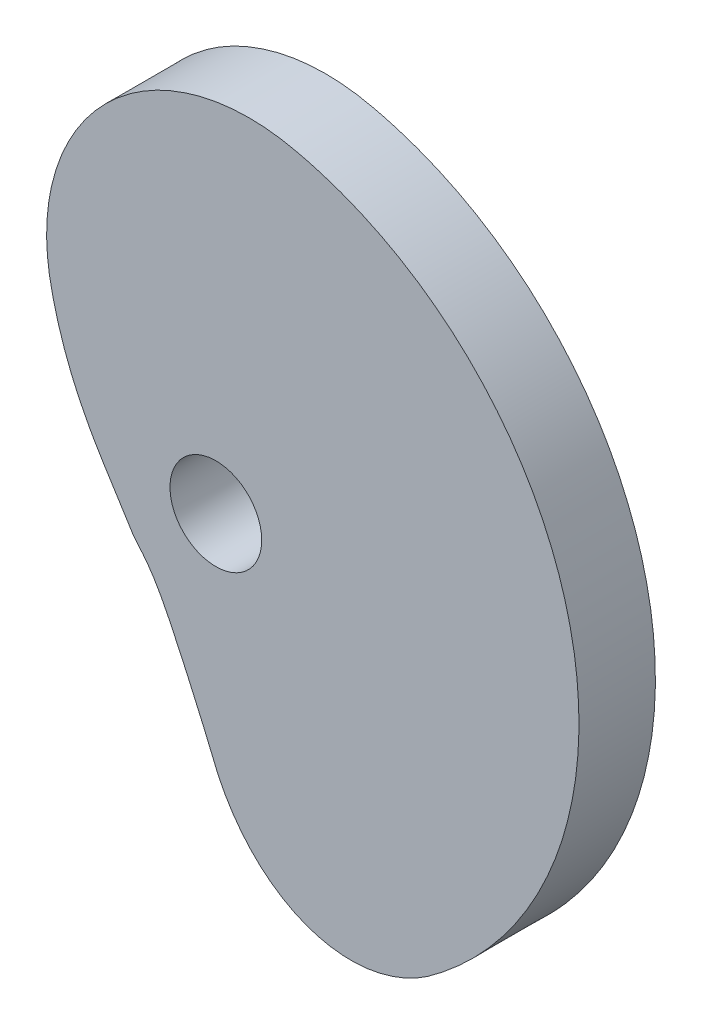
ISO-10303-21;
HEADER;
FILE_DESCRIPTION(('STEP AP214'),'2;1');
FILE_NAME('part.step','',(''),(''),'','','');
FILE_SCHEMA(('AUTOMOTIVE_DESIGN { 1 0 10303 214 1 1 1 1 }'));
ENDSEC;
DATA;
#1=APPLICATION_CONTEXT('core data for automotive mechanical design processes');
#2=APPLICATION_PROTOCOL_DEFINITION('international standard','automotive_design',2000,#1);
#3=PRODUCT_CONTEXT('',#1,'mechanical');
#4=PRODUCT('Part','Part','',(#3));
#5=PRODUCT_RELATED_PRODUCT_CATEGORY('part','',(#4));
#6=PRODUCT_DEFINITION_FORMATION('','',#4);
#7=PRODUCT_DEFINITION_CONTEXT('part definition',#1,'design');
#8=PRODUCT_DEFINITION('design','',#6,#7);
#9=PRODUCT_DEFINITION_SHAPE('','',#8);
#10=(LENGTH_UNIT() NAMED_UNIT(*) SI_UNIT(.MILLI.,.METRE.));
#11=(NAMED_UNIT(*) PLANE_ANGLE_UNIT() SI_UNIT($,.RADIAN.));
#12=(NAMED_UNIT(*) SI_UNIT($,.STERADIAN.) SOLID_ANGLE_UNIT());
#13=UNCERTAINTY_MEASURE_WITH_UNIT(LENGTH_MEASURE(1.E-05),#10,'distance_accuracy_value','');
#14=(GEOMETRIC_REPRESENTATION_CONTEXT(3) GLOBAL_UNCERTAINTY_ASSIGNED_CONTEXT((#13)) GLOBAL_UNIT_ASSIGNED_CONTEXT((#10,
#11,#12)) REPRESENTATION_CONTEXT('',''));
#15=CARTESIAN_POINT('',(0.,0.,0.));
#16=DIRECTION('',(0.,0.,1.));
#17=DIRECTION('',(1.,0.,0.));
#18=AXIS2_PLACEMENT_3D('',#15,#16,#17);
#19=CARTESIAN_POINT('',(-243.24,399.51,20.));
#20=CARTESIAN_POINT('',(-244.338434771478,399.760268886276,20.));
#21=CARTESIAN_POINT('',(-246.531233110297,400.226111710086,20.));
#22=CARTESIAN_POINT('',(-249.865205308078,400.696137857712,20.));
#23=CARTESIAN_POINT('',(-253.225113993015,400.954969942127,20.));
#24=CARTESIAN_POINT('',(-256.621936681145,401.0070308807,20.));
#25=CARTESIAN_POINT('',(-260.038887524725,400.835337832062,20.));
#26=CARTESIAN_POINT('',(-263.4666556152,400.446376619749,20.));
#27=CARTESIAN_POINT('',(-266.884264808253,399.825919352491,20.));
#28=CARTESIAN_POINT('',(-270.276058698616,398.977262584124,20.));
#29=CARTESIAN_POINT('',(-273.620748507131,397.890793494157,20.));
#30=CARTESIAN_POINT('',(-276.91421130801,396.59313017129,20.));
#31=CARTESIAN_POINT('',(-280.134886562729,395.065386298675,20.));
#32=CARTESIAN_POINT('',(-283.25851252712,393.298166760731,20.));
#33=CARTESIAN_POINT('',(-286.274131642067,391.323726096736,20.));
#34=CARTESIAN_POINT('',(-289.16299282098,389.134181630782,20.));
#35=CARTESIAN_POINT('',(-291.914147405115,386.75054482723,20.));
#36=CARTESIAN_POINT('',(-294.48975810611,384.156734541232,20.));
#37=CARTESIAN_POINT('',(-296.89836174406,381.389877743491,20.));
#38=CARTESIAN_POINT('',(-299.11378921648,378.458418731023,20.));
#39=CARTESIAN_POINT('',(-301.118346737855,375.368362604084,20.));
#40=CARTESIAN_POINT('',(-302.904366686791,372.148714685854,20.));
#41=CARTESIAN_POINT('',(-304.482469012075,368.820540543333,20.));
#42=CARTESIAN_POINT('',(-305.799253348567,365.384331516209,20.));
#43=CARTESIAN_POINT('',(-306.875225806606,361.878119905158,20.));
#44=CARTESIAN_POINT('',(-307.722963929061,358.325895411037,20.));
#45=CARTESIAN_POINT('',(-308.300140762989,354.742159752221,20.));
#46=CARTESIAN_POINT('',(-308.627718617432,351.156996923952,20.));
#47=CARTESIAN_POINT('',(-308.72197339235,347.592170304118,20.));
#48=CARTESIAN_POINT('',(-308.565447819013,344.072017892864,20.));
#49=CARTESIAN_POINT('',(-308.206654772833,340.616249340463,20.));
#50=CARTESIAN_POINT('',(-307.601808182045,337.289385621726,20.));
#51=CARTESIAN_POINT('',(-306.901779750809,334.135229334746,20.));
#52=CARTESIAN_POINT('',(-306.153436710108,331.187218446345,20.));
#53=CARTESIAN_POINT('',(-305.355444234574,328.450284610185,20.));
#54=CARTESIAN_POINT('',(-304.552837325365,325.90012362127,20.));
#55=CARTESIAN_POINT('',(-303.713850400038,323.530052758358,20.));
#56=CARTESIAN_POINT('',(-302.878924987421,321.321887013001,20.));
#57=CARTESIAN_POINT('',(-302.030151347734,319.266283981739,20.));
#58=CARTESIAN_POINT('',(-301.20682356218,317.341305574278,20.));
#59=CARTESIAN_POINT('',(-300.36734876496,315.551608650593,20.));
#60=CARTESIAN_POINT('',(-299.563166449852,313.86684402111,20.));
#61=CARTESIAN_POINT('',(-298.755790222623,312.295258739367,20.));
#62=CARTESIAN_POINT('',(-297.978895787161,310.813423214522,20.));
#63=CARTESIAN_POINT('',(-297.211878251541,309.420479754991,20.));
#64=CARTESIAN_POINT('',(-296.479837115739,308.097167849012,20.));
#65=CARTESIAN_POINT('',(-295.736862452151,306.858498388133,20.));
#66=CARTESIAN_POINT('',(-295.046334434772,305.667576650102,20.));
#67=CARTESIAN_POINT('',(-294.360714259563,304.544168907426,20.));
#68=CARTESIAN_POINT('',(-293.696735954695,303.475340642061,20.));
#69=CARTESIAN_POINT('',(-293.069209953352,302.439713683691,20.));
#70=CARTESIAN_POINT('',(-292.449979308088,301.449104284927,20.));
#71=CARTESIAN_POINT('',(-291.834462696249,300.503524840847,20.));
#72=CARTESIAN_POINT('',(-291.25515606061,299.575510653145,20.));
#73=CARTESIAN_POINT('',(-290.686333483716,298.680213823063,20.));
#74=CARTESIAN_POINT('',(-290.13348723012,297.808661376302,20.));
#75=CARTESIAN_POINT('',(-289.604261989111,296.956087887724,20.));
#76=CARTESIAN_POINT('',(-289.083251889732,296.121284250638,20.));
#77=CARTESIAN_POINT('',(-288.560653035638,295.30710294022,20.));
#78=CARTESIAN_POINT('',(-288.0602445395,294.491877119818,20.));
#79=CARTESIAN_POINT('',(-287.570411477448,293.685106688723,20.));
#80=CARTESIAN_POINT('',(-287.09652465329,292.878533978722,20.));
#81=CARTESIAN_POINT('',(-286.592206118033,292.095207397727,20.));
#82=CARTESIAN_POINT('',(-286.06489875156,291.32602608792,20.));
#83=CARTESIAN_POINT('',(-285.507253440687,290.579139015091,20.));
#84=CARTESIAN_POINT('',(-284.919837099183,289.855189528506,20.));
#85=CARTESIAN_POINT('',(-284.319062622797,289.142821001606,20.));
#86=CARTESIAN_POINT('',(-283.667868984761,288.477375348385,20.));
#87=CARTESIAN_POINT('',(-283.112596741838,287.734380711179,20.));
#88=CARTESIAN_POINT('',(-282.532890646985,287.013878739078,20.));
#89=CARTESIAN_POINT('',(-281.986673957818,286.25805123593,20.));
#90=CARTESIAN_POINT('',(-281.441817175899,285.48786481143,20.));
#91=CARTESIAN_POINT('',(-280.914280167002,284.683708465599,20.));
#92=CARTESIAN_POINT('',(-280.381928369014,283.857095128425,20.));
#93=CARTESIAN_POINT('',(-279.860334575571,282.987074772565,20.));
#94=CARTESIAN_POINT('',(-279.33246823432,282.086187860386,20.));
#95=CARTESIAN_POINT('',(-278.809457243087,281.137212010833,20.));
#96=CARTESIAN_POINT('',(-278.285352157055,280.14562516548,20.));
#97=CARTESIAN_POINT('',(-277.722205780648,279.115864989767,20.));
#98=CARTESIAN_POINT('',(-277.18415993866,278.012881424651,20.));
#99=CARTESIAN_POINT('',(-276.605812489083,276.860364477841,20.));
#100=CARTESIAN_POINT('',(-276.019996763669,275.636660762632,20.));
#101=CARTESIAN_POINT('',(-275.396410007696,274.349961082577,20.));
#102=CARTESIAN_POINT('',(-274.757483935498,272.979616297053,20.));
#103=CARTESIAN_POINT('',(-274.071066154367,271.530807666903,20.));
#104=CARTESIAN_POINT('',(-273.367530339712,269.974736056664,20.));
#105=CARTESIAN_POINT('',(-272.598147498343,268.323889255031,20.));
#106=CARTESIAN_POINT('',(-271.802729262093,266.545428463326,20.));
#107=CARTESIAN_POINT('',(-270.934470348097,264.64398025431,20.));
#108=CARTESIAN_POINT('',(-270.026113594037,262.588371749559,20.));
#109=CARTESIAN_POINT('',(-269.050639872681,260.364514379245,20.));
#110=CARTESIAN_POINT('',(-267.997598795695,257.953924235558,20.));
#111=CARTESIAN_POINT('',(-266.869329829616,255.315883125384,20.));
#112=CARTESIAN_POINT('',(-265.6664889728,252.427622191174,20.));
#113=CARTESIAN_POINT('',(-264.441191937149,249.338374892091,20.));
#114=CARTESIAN_POINT('',(-262.978970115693,246.255685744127,20.));
#115=CARTESIAN_POINT('',(-261.33026954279,243.289519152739,20.));
#116=CARTESIAN_POINT('',(-259.496696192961,240.480353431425,20.));
#117=CARTESIAN_POINT('',(-257.509921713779,237.824749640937,20.));
#118=CARTESIAN_POINT('',(-255.35707216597,235.351664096,20.));
#119=CARTESIAN_POINT('',(-253.057169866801,233.069066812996,20.));
#120=CARTESIAN_POINT('',(-250.617301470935,230.988567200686,20.));
#121=CARTESIAN_POINT('',(-248.02814847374,229.154823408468,20.));
#122=CARTESIAN_POINT('',(-245.34241726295,227.519719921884,20.));
#123=CARTESIAN_POINT('',(-242.534325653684,226.165569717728,20.));
#124=CARTESIAN_POINT('',(-239.646979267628,225.0472381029,20.));
#125=CARTESIAN_POINT('',(-236.683176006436,224.194352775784,20.));
#126=CARTESIAN_POINT('',(-233.657017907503,223.619431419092,20.));
#127=CARTESIAN_POINT('',(-230.589657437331,223.348274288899,20.));
#128=CARTESIAN_POINT('',(-227.503123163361,223.32665187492,20.));
#129=CARTESIAN_POINT('',(-224.414130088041,223.627462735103,20.));
#130=CARTESIAN_POINT('',(-221.341112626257,224.194800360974,20.));
#131=CARTESIAN_POINT('',(-218.307526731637,225.050509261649,20.));
#132=CARTESIAN_POINT('',(-215.326192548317,226.170586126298,20.));
#133=CARTESIAN_POINT('',(-212.429925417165,227.577866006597,20.));
#134=CARTESIAN_POINT('',(-209.612541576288,229.232475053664,20.));
#135=CARTESIAN_POINT('',(-206.960990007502,231.190015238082,20.));
#136=CARTESIAN_POINT('',(-204.344722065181,233.221403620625,20.));
#137=CARTESIAN_POINT('',(-201.816072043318,235.367702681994,20.));
#138=CARTESIAN_POINT('',(-199.361707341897,237.595848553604,20.));
#139=CARTESIAN_POINT('',(-196.97002412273,239.896873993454,20.));
#140=CARTESIAN_POINT('',(-194.679257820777,242.295671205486,20.));
#141=CARTESIAN_POINT('',(-192.46645092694,244.765680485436,20.));
#142=CARTESIAN_POINT('',(-190.343525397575,247.31187005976,20.));
#143=CARTESIAN_POINT('',(-188.30383664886,249.926208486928,20.));
#144=CARTESIAN_POINT('',(-186.365717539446,252.616963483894,20.));
#145=CARTESIAN_POINT('',(-184.522561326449,255.372729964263,20.));
#146=CARTESIAN_POINT('',(-182.772683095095,258.189810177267,20.));
#147=CARTESIAN_POINT('',(-181.125309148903,261.070200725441,20.));
#148=CARTESIAN_POINT('',(-179.571825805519,263.998900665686,20.));
#149=CARTESIAN_POINT('',(-178.132902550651,266.983409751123,20.));
#150=CARTESIAN_POINT('',(-176.793004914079,270.015326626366,20.));
#151=CARTESIAN_POINT('',(-175.548771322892,273.090068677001,20.));
#152=CARTESIAN_POINT('',(-174.434786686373,276.216802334,20.));
#153=CARTESIAN_POINT('',(-173.409077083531,279.371532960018,20.));
#154=CARTESIAN_POINT('',(-172.512306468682,282.565723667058,20.));
#155=CARTESIAN_POINT('',(-171.722055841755,285.784232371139,20.));
#156=CARTESIAN_POINT('',(-171.041336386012,289.029344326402,20.));
#157=CARTESIAN_POINT('',(-170.469584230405,292.293948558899,20.));
#158=CARTESIAN_POINT('',(-170.022599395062,295.58016467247,20.));
#159=CARTESIAN_POINT('',(-169.678532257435,298.878127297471,20.));
#160=CARTESIAN_POINT('',(-169.463189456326,302.187355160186,20.));
#161=CARTESIAN_POINT('',(-169.349254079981,305.502362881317,20.));
#162=CARTESIAN_POINT('',(-169.359550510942,308.817983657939,20.));
#163=CARTESIAN_POINT('',(-169.492258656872,312.133066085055,20.));
#164=CARTESIAN_POINT('',(-169.732115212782,315.441504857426,20.));
#165=CARTESIAN_POINT('',(-170.079216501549,318.74087524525,20.));
#166=CARTESIAN_POINT('',(-170.549546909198,322.023162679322,20.));
#167=CARTESIAN_POINT('',(-171.142262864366,325.28415949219,20.));
#168=CARTESIAN_POINT('',(-171.842577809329,328.525942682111,20.));
#169=CARTESIAN_POINT('',(-172.64969802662,331.74208821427,20.));
#170=CARTESIAN_POINT('',(-173.573390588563,334.926373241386,20.));
#171=CARTESIAN_POINT('',(-174.598541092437,338.078064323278,20.));
#172=CARTESIAN_POINT('',(-175.753998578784,341.185929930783,20.));
#173=CARTESIAN_POINT('',(-177.005044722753,344.257127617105,20.));
#174=CARTESIAN_POINT('',(-178.348658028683,347.292146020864,20.));
#175=CARTESIAN_POINT('',(-179.82449031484,350.263420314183,20.));
#176=CARTESIAN_POINT('',(-181.382703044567,353.193362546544,20.));
#177=CARTESIAN_POINT('',(-183.051813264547,356.055915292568,20.));
#178=CARTESIAN_POINT('',(-184.817882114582,358.862874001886,20.));
#179=CARTESIAN_POINT('',(-186.669080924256,361.611616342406,20.));
#180=CARTESIAN_POINT('',(-188.639022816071,364.281135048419,20.));
#181=CARTESIAN_POINT('',(-190.681620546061,366.892763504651,20.));
#182=CARTESIAN_POINT('',(-192.82826486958,369.420239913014,20.));
#183=CARTESIAN_POINT('',(-195.044783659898,371.885604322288,20.));
#184=CARTESIAN_POINT('',(-197.357567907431,374.262650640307,20.));
#185=CARTESIAN_POINT('',(-199.745443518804,376.564332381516,20.));
#186=CARTESIAN_POINT('',(-202.216753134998,378.776379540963,20.));
#187=CARTESIAN_POINT('',(-204.771201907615,380.893241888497,20.));
#188=CARTESIAN_POINT('',(-207.385829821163,382.93663644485,20.));
#189=CARTESIAN_POINT('',(-210.077127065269,384.874046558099,20.));
#190=CARTESIAN_POINT('',(-212.83245336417,386.717910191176,20.));
#191=CARTESIAN_POINT('',(-215.648298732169,388.464137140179,20.));
#192=CARTESIAN_POINT('',(-218.521659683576,390.117993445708,20.));
#193=CARTESIAN_POINT('',(-221.453728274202,391.668558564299,20.));
#194=CARTESIAN_POINT('',(-224.438994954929,393.11575216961,20.));
#195=CARTESIAN_POINT('',(-227.472749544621,394.460327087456,20.));
#196=CARTESIAN_POINT('',(-230.554929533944,395.684924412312,20.));
#197=CARTESIAN_POINT('',(-233.669294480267,396.820716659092,20.));
#198=CARTESIAN_POINT('',(-236.828517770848,397.825543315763,20.));
#199=CARTESIAN_POINT('',(-240.013541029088,398.742189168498,20.));
#200=CARTESIAN_POINT('',(-242.162250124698,399.264443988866,20.));
#201=CARTESIAN_POINT('',(-243.24,399.51,20.));
#202=B_SPLINE_CURVE_WITH_KNOTS('',3,(#19,#20,#21,#22,#23,#24,#25,#26,#27,#28,#29,#30,#31,#32,
#33,#34,#35,#36,#37,#38,#39,#40,#41,#42,#43,#44,#45,#46,#47,#48,#49,#50,#51,#52,#53,#54,#55,#56,
#57,#58,#59,#60,#61,#62,#63,#64,#65,#66,#67,#68,#69,#70,#71,#72,#73,#74,#75,#76,#77,#78,#79,#80,
#81,#82,#83,#84,#85,#86,#87,#88,#89,#90,#91,#92,#93,#94,#95,#96,#97,#98,#99,#100,#101,#102,#103,
#104,#105,#106,#107,#108,#109,#110,#111,#112,#113,#114,#115,#116,#117,#118,#119,#120,#121,#122,
#123,#124,#125,#126,#127,#128,#129,#130,#131,#132,#133,#134,#135,#136,#137,#138,#139,#140,#141,
#142,#143,#144,#145,#146,#147,#148,#149,#150,#151,#152,#153,#154,#155,#156,#157,#158,#159,#160,
#161,#162,#163,#164,#165,#166,#167,#168,#169,#170,#171,#172,#173,#174,#175,#176,#177,#178,#179,
#180,#181,#182,#183,#184,#185,#186,#187,#188,#189,#190,#191,#192,#193,#194,#195,#196,#197,#198,
#199,#200,#201),.UNSPECIFIED.,.T.,.F.,(4,1,1,1,1,1,1,1,1,1,1,1,1,1,1,1,1,1,1,1,1,1,1,1,1,1,1,1,
1,1,1,1,1,1,1,1,1,1,1,1,1,1,1,1,1,1,1,1,1,1,1,1,1,1,1,1,1,1,1,1,1,1,1,1,1,1,1,1,1,1,1,1,1,1,1,1,
1,1,1,1,1,1,1,1,1,1,1,1,1,1,1,1,1,1,1,1,1,1,1,1,1,1,1,1,1,1,1,1,1,1,1,1,1,1,1,1,1,1,1,1,1,1,1,1,
1,1,1,1,1,1,1,1,1,1,1,1,1,1,1,1,1,1,1,1,1,1,1,1,1,1,1,1,1,1,1,1,1,1,1,1,1,1,1,1,1,1,1,1,1,1,1,1,
1,1,1,1,1,1,1,1,4),(0.,0.00688265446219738,0.0136921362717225,0.0205562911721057,
0.0274618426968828,0.0344363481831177,0.0414473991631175,0.0485268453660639,0.0556453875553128,
0.0627951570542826,0.070000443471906,0.0772617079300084,0.0845579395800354,0.0919132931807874,
0.0992703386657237,0.106691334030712,0.114137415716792,0.121587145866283,0.129090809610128,
0.136570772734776,0.144074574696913,0.151573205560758,0.159058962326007,0.166538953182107,
0.173969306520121,0.181356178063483,0.188699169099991,0.195952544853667,0.203128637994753,
0.210216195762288,0.217164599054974,0.223776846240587,0.22995685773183,0.235745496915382,
0.241195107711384,0.246290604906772,0.251106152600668,0.255618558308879,0.259879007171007,
0.263897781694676,0.267696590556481,0.271285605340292,0.274693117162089,0.277919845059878,
0.281002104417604,0.283932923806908,0.286744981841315,0.289413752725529,0.291974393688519,
0.294433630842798,0.296812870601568,0.299112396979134,0.301327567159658,0.303497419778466,
0.305593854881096,0.30763412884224,0.309629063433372,0.311606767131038,0.313545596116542,
0.315473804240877,0.317374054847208,0.319261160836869,0.321165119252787,0.3230715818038,
0.324954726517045,0.326861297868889,0.32876438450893,0.330634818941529,0.332521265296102,
0.334415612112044,0.336331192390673,0.338285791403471,0.340291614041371,0.34233858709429,
0.344483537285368,0.346671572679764,0.348958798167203,0.351337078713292,0.353842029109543,
0.356456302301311,0.359216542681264,0.36213174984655,0.36519321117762,0.368455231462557,
0.371927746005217,0.375627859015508,0.379584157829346,0.383832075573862,0.388400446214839,
0.393316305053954,0.398670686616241,0.404474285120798,0.410847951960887,0.417788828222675,
0.424776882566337,0.431679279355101,0.438509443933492,0.44525944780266,0.4519293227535,
0.45852570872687,0.465043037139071,0.471497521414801,0.477893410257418,0.48423363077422,
0.49052026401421,0.496792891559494,0.50305267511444,0.509311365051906,0.515584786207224,
0.521885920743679,0.528245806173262,0.534655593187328,0.541120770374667,0.547679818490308,
0.554309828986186,0.561053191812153,0.56780046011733,0.574549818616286,0.581312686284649,
0.588054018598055,0.594824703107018,0.601575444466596,0.608314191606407,0.615077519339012,
0.621832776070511,0.628572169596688,0.635332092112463,0.642092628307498,0.648844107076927,
0.655585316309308,0.66233344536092,0.669096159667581,0.675848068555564,0.682611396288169,
0.68936247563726,0.696115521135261,0.702858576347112,0.709619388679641,0.716362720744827,
0.723119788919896,0.729876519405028,0.73662209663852,0.743384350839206,0.750131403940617,
0.756890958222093,0.763650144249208,0.770399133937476,0.777147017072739,0.783898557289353,
0.790661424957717,0.797404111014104,0.804154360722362,0.810908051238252,0.817659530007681,
0.824415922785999,0.831183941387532,0.837926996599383,0.844690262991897,0.851426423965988,
0.858188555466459,0.864934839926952,0.871694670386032,0.878444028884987,0.885193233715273,
0.891948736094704,0.898704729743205,0.905455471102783,0.912209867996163,0.918973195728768,
0.925728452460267,0.932467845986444,0.939227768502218,0.945970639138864,0.952722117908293,
0.959490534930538,0.96623866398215,0.972993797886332,0.979752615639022,0.986490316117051,
0.993246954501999,1.),.UNSPECIFIED.);
#203=DIRECTION('',(0.,0.,-1.));
#204=VECTOR('',#203,1.);
#205=SURFACE_OF_LINEAR_EXTRUSION('',#202,#204);
#206=CARTESIAN_POINT('',(-243.24,399.51,20.));
#207=VERTEX_POINT('',#206);
#208=EDGE_CURVE('E10',#207,#207,#202,.T.);
#209=ORIENTED_EDGE('',*,*,#208,.F.);
#210=EDGE_LOOP('',(#209));
#211=FACE_BOUND('',#210,.T.);
#212=CARTESIAN_POINT('',(-243.24,399.51,0.));
#213=CARTESIAN_POINT('',(-244.338434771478,399.760268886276,0.));
#214=CARTESIAN_POINT('',(-246.531233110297,400.226111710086,0.));
#215=CARTESIAN_POINT('',(-249.865205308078,400.696137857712,0.));
#216=CARTESIAN_POINT('',(-253.225113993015,400.954969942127,0.));
#217=CARTESIAN_POINT('',(-256.621936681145,401.0070308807,0.));
#218=CARTESIAN_POINT('',(-260.038887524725,400.835337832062,0.));
#219=CARTESIAN_POINT('',(-263.4666556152,400.446376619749,0.));
#220=CARTESIAN_POINT('',(-266.884264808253,399.825919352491,0.));
#221=CARTESIAN_POINT('',(-270.276058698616,398.977262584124,0.));
#222=CARTESIAN_POINT('',(-273.620748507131,397.890793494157,0.));
#223=CARTESIAN_POINT('',(-276.91421130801,396.59313017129,0.));
#224=CARTESIAN_POINT('',(-280.134886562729,395.065386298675,0.));
#225=CARTESIAN_POINT('',(-283.25851252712,393.298166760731,0.));
#226=CARTESIAN_POINT('',(-286.274131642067,391.323726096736,0.));
#227=CARTESIAN_POINT('',(-289.16299282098,389.134181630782,0.));
#228=CARTESIAN_POINT('',(-291.914147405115,386.75054482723,0.));
#229=CARTESIAN_POINT('',(-294.48975810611,384.156734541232,0.));
#230=CARTESIAN_POINT('',(-296.89836174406,381.389877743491,0.));
#231=CARTESIAN_POINT('',(-299.11378921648,378.458418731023,0.));
#232=CARTESIAN_POINT('',(-301.118346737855,375.368362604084,0.));
#233=CARTESIAN_POINT('',(-302.904366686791,372.148714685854,0.));
#234=CARTESIAN_POINT('',(-304.482469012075,368.820540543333,0.));
#235=CARTESIAN_POINT('',(-305.799253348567,365.384331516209,0.));
#236=CARTESIAN_POINT('',(-306.875225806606,361.878119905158,0.));
#237=CARTESIAN_POINT('',(-307.722963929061,358.325895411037,0.));
#238=CARTESIAN_POINT('',(-308.300140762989,354.742159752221,0.));
#239=CARTESIAN_POINT('',(-308.627718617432,351.156996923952,0.));
#240=CARTESIAN_POINT('',(-308.72197339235,347.592170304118,0.));
#241=CARTESIAN_POINT('',(-308.565447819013,344.072017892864,0.));
#242=CARTESIAN_POINT('',(-308.206654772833,340.616249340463,0.));
#243=CARTESIAN_POINT('',(-307.601808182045,337.289385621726,0.));
#244=CARTESIAN_POINT('',(-306.901779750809,334.135229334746,0.));
#245=CARTESIAN_POINT('',(-306.153436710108,331.187218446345,0.));
#246=CARTESIAN_POINT('',(-305.355444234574,328.450284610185,0.));
#247=CARTESIAN_POINT('',(-304.552837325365,325.90012362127,0.));
#248=CARTESIAN_POINT('',(-303.713850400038,323.530052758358,0.));
#249=CARTESIAN_POINT('',(-302.878924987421,321.321887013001,0.));
#250=CARTESIAN_POINT('',(-302.030151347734,319.266283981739,0.));
#251=CARTESIAN_POINT('',(-301.20682356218,317.341305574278,0.));
#252=CARTESIAN_POINT('',(-300.36734876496,315.551608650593,0.));
#253=CARTESIAN_POINT('',(-299.563166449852,313.86684402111,0.));
#254=CARTESIAN_POINT('',(-298.755790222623,312.295258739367,0.));
#255=CARTESIAN_POINT('',(-297.978895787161,310.813423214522,0.));
#256=CARTESIAN_POINT('',(-297.211878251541,309.420479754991,0.));
#257=CARTESIAN_POINT('',(-296.479837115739,308.097167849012,0.));
#258=CARTESIAN_POINT('',(-295.736862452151,306.858498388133,0.));
#259=CARTESIAN_POINT('',(-295.046334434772,305.667576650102,0.));
#260=CARTESIAN_POINT('',(-294.360714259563,304.544168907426,0.));
#261=CARTESIAN_POINT('',(-293.696735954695,303.475340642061,0.));
#262=CARTESIAN_POINT('',(-293.069209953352,302.439713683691,0.));
#263=CARTESIAN_POINT('',(-292.449979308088,301.449104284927,0.));
#264=CARTESIAN_POINT('',(-291.834462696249,300.503524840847,0.));
#265=CARTESIAN_POINT('',(-291.25515606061,299.575510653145,0.));
#266=CARTESIAN_POINT('',(-290.686333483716,298.680213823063,0.));
#267=CARTESIAN_POINT('',(-290.13348723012,297.808661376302,0.));
#268=CARTESIAN_POINT('',(-289.604261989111,296.956087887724,0.));
#269=CARTESIAN_POINT('',(-289.083251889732,296.121284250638,0.));
#270=CARTESIAN_POINT('',(-288.560653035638,295.30710294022,0.));
#271=CARTESIAN_POINT('',(-288.0602445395,294.491877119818,0.));
#272=CARTESIAN_POINT('',(-287.570411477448,293.685106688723,0.));
#273=CARTESIAN_POINT('',(-287.09652465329,292.878533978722,0.));
#274=CARTESIAN_POINT('',(-286.592206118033,292.095207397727,0.));
#275=CARTESIAN_POINT('',(-286.06489875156,291.32602608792,0.));
#276=CARTESIAN_POINT('',(-285.507253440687,290.579139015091,0.));
#277=CARTESIAN_POINT('',(-284.919837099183,289.855189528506,0.));
#278=CARTESIAN_POINT('',(-284.319062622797,289.142821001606,0.));
#279=CARTESIAN_POINT('',(-283.667868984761,288.477375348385,0.));
#280=CARTESIAN_POINT('',(-283.112596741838,287.734380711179,0.));
#281=CARTESIAN_POINT('',(-282.532890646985,287.013878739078,0.));
#282=CARTESIAN_POINT('',(-281.986673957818,286.25805123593,0.));
#283=CARTESIAN_POINT('',(-281.441817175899,285.48786481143,0.));
#284=CARTESIAN_POINT('',(-280.914280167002,284.683708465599,0.));
#285=CARTESIAN_POINT('',(-280.381928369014,283.857095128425,0.));
#286=CARTESIAN_POINT('',(-279.860334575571,282.987074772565,0.));
#287=CARTESIAN_POINT('',(-279.33246823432,282.086187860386,0.));
#288=CARTESIAN_POINT('',(-278.809457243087,281.137212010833,0.));
#289=CARTESIAN_POINT('',(-278.285352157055,280.14562516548,0.));
#290=CARTESIAN_POINT('',(-277.722205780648,279.115864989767,0.));
#291=CARTESIAN_POINT('',(-277.18415993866,278.012881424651,0.));
#292=CARTESIAN_POINT('',(-276.605812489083,276.860364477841,0.));
#293=CARTESIAN_POINT('',(-276.019996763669,275.636660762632,0.));
#294=CARTESIAN_POINT('',(-275.396410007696,274.349961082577,0.));
#295=CARTESIAN_POINT('',(-274.757483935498,272.979616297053,0.));
#296=CARTESIAN_POINT('',(-274.071066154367,271.530807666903,0.));
#297=CARTESIAN_POINT('',(-273.367530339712,269.974736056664,0.));
#298=CARTESIAN_POINT('',(-272.598147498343,268.323889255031,0.));
#299=CARTESIAN_POINT('',(-271.802729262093,266.545428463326,0.));
#300=CARTESIAN_POINT('',(-270.934470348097,264.64398025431,0.));
#301=CARTESIAN_POINT('',(-270.026113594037,262.588371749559,0.));
#302=CARTESIAN_POINT('',(-269.050639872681,260.364514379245,0.));
#303=CARTESIAN_POINT('',(-267.997598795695,257.953924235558,0.));
#304=CARTESIAN_POINT('',(-266.869329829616,255.315883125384,0.));
#305=CARTESIAN_POINT('',(-265.6664889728,252.427622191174,0.));
#306=CARTESIAN_POINT('',(-264.441191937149,249.338374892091,0.));
#307=CARTESIAN_POINT('',(-262.978970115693,246.255685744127,0.));
#308=CARTESIAN_POINT('',(-261.33026954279,243.289519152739,0.));
#309=CARTESIAN_POINT('',(-259.496696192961,240.480353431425,0.));
#310=CARTESIAN_POINT('',(-257.509921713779,237.824749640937,0.));
#311=CARTESIAN_POINT('',(-255.35707216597,235.351664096,0.));
#312=CARTESIAN_POINT('',(-253.057169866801,233.069066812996,0.));
#313=CARTESIAN_POINT('',(-250.617301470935,230.988567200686,0.));
#314=CARTESIAN_POINT('',(-248.02814847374,229.154823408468,0.));
#315=CARTESIAN_POINT('',(-245.34241726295,227.519719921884,0.));
#316=CARTESIAN_POINT('',(-242.534325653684,226.165569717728,0.));
#317=CARTESIAN_POINT('',(-239.646979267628,225.0472381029,0.));
#318=CARTESIAN_POINT('',(-236.683176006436,224.194352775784,0.));
#319=CARTESIAN_POINT('',(-233.657017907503,223.619431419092,0.));
#320=CARTESIAN_POINT('',(-230.589657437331,223.348274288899,0.));
#321=CARTESIAN_POINT('',(-227.503123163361,223.32665187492,0.));
#322=CARTESIAN_POINT('',(-224.414130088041,223.627462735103,0.));
#323=CARTESIAN_POINT('',(-221.341112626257,224.194800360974,0.));
#324=CARTESIAN_POINT('',(-218.307526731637,225.050509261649,0.));
#325=CARTESIAN_POINT('',(-215.326192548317,226.170586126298,0.));
#326=CARTESIAN_POINT('',(-212.429925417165,227.577866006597,0.));
#327=CARTESIAN_POINT('',(-209.612541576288,229.232475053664,0.));
#328=CARTESIAN_POINT('',(-206.960990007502,231.190015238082,0.));
#329=CARTESIAN_POINT('',(-204.344722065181,233.221403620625,0.));
#330=CARTESIAN_POINT('',(-201.816072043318,235.367702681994,0.));
#331=CARTESIAN_POINT('',(-199.361707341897,237.595848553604,0.));
#332=CARTESIAN_POINT('',(-196.97002412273,239.896873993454,0.));
#333=CARTESIAN_POINT('',(-194.679257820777,242.295671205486,0.));
#334=CARTESIAN_POINT('',(-192.46645092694,244.765680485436,0.));
#335=CARTESIAN_POINT('',(-190.343525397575,247.31187005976,0.));
#336=CARTESIAN_POINT('',(-188.30383664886,249.926208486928,0.));
#337=CARTESIAN_POINT('',(-186.365717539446,252.616963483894,0.));
#338=CARTESIAN_POINT('',(-184.522561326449,255.372729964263,0.));
#339=CARTESIAN_POINT('',(-182.772683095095,258.189810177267,0.));
#340=CARTESIAN_POINT('',(-181.125309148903,261.070200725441,0.));
#341=CARTESIAN_POINT('',(-179.571825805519,263.998900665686,0.));
#342=CARTESIAN_POINT('',(-178.132902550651,266.983409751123,0.));
#343=CARTESIAN_POINT('',(-176.793004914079,270.015326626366,0.));
#344=CARTESIAN_POINT('',(-175.548771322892,273.090068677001,0.));
#345=CARTESIAN_POINT('',(-174.434786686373,276.216802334,0.));
#346=CARTESIAN_POINT('',(-173.409077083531,279.371532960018,0.));
#347=CARTESIAN_POINT('',(-172.512306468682,282.565723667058,0.));
#348=CARTESIAN_POINT('',(-171.722055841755,285.784232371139,0.));
#349=CARTESIAN_POINT('',(-171.041336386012,289.029344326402,0.));
#350=CARTESIAN_POINT('',(-170.469584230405,292.293948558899,0.));
#351=CARTESIAN_POINT('',(-170.022599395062,295.58016467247,0.));
#352=CARTESIAN_POINT('',(-169.678532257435,298.878127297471,0.));
#353=CARTESIAN_POINT('',(-169.463189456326,302.187355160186,0.));
#354=CARTESIAN_POINT('',(-169.349254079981,305.502362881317,0.));
#355=CARTESIAN_POINT('',(-169.359550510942,308.817983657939,0.));
#356=CARTESIAN_POINT('',(-169.492258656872,312.133066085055,0.));
#357=CARTESIAN_POINT('',(-169.732115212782,315.441504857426,0.));
#358=CARTESIAN_POINT('',(-170.079216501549,318.74087524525,0.));
#359=CARTESIAN_POINT('',(-170.549546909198,322.023162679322,0.));
#360=CARTESIAN_POINT('',(-171.142262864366,325.28415949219,0.));
#361=CARTESIAN_POINT('',(-171.842577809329,328.525942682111,0.));
#362=CARTESIAN_POINT('',(-172.64969802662,331.74208821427,0.));
#363=CARTESIAN_POINT('',(-173.573390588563,334.926373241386,0.));
#364=CARTESIAN_POINT('',(-174.598541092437,338.078064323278,0.));
#365=CARTESIAN_POINT('',(-175.753998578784,341.185929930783,0.));
#366=CARTESIAN_POINT('',(-177.005044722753,344.257127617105,0.));
#367=CARTESIAN_POINT('',(-178.348658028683,347.292146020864,0.));
#368=CARTESIAN_POINT('',(-179.82449031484,350.263420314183,0.));
#369=CARTESIAN_POINT('',(-181.382703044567,353.193362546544,0.));
#370=CARTESIAN_POINT('',(-183.051813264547,356.055915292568,0.));
#371=CARTESIAN_POINT('',(-184.817882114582,358.862874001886,0.));
#372=CARTESIAN_POINT('',(-186.669080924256,361.611616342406,0.));
#373=CARTESIAN_POINT('',(-188.639022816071,364.281135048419,0.));
#374=CARTESIAN_POINT('',(-190.681620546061,366.892763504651,0.));
#375=CARTESIAN_POINT('',(-192.82826486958,369.420239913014,0.));
#376=CARTESIAN_POINT('',(-195.044783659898,371.885604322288,0.));
#377=CARTESIAN_POINT('',(-197.357567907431,374.262650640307,0.));
#378=CARTESIAN_POINT('',(-199.745443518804,376.564332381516,0.));
#379=CARTESIAN_POINT('',(-202.216753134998,378.776379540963,0.));
#380=CARTESIAN_POINT('',(-204.771201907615,380.893241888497,0.));
#381=CARTESIAN_POINT('',(-207.385829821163,382.93663644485,0.));
#382=CARTESIAN_POINT('',(-210.077127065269,384.874046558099,0.));
#383=CARTESIAN_POINT('',(-212.83245336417,386.717910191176,0.));
#384=CARTESIAN_POINT('',(-215.648298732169,388.464137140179,0.));
#385=CARTESIAN_POINT('',(-218.521659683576,390.117993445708,0.));
#386=CARTESIAN_POINT('',(-221.453728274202,391.668558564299,0.));
#387=CARTESIAN_POINT('',(-224.438994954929,393.11575216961,0.));
#388=CARTESIAN_POINT('',(-227.472749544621,394.460327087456,0.));
#389=CARTESIAN_POINT('',(-230.554929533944,395.684924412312,0.));
#390=CARTESIAN_POINT('',(-233.669294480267,396.820716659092,0.));
#391=CARTESIAN_POINT('',(-236.828517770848,397.825543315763,0.));
#392=CARTESIAN_POINT('',(-240.013541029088,398.742189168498,0.));
#393=CARTESIAN_POINT('',(-242.162250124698,399.264443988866,0.));
#394=CARTESIAN_POINT('',(-243.24,399.51,0.));
#395=B_SPLINE_CURVE_WITH_KNOTS('',3,(#212,#213,#214,#215,#216,#217,#218,#219,#220,#221,#222,
#223,#224,#225,#226,#227,#228,#229,#230,#231,#232,#233,#234,#235,#236,#237,#238,#239,#240,#241,
#242,#243,#244,#245,#246,#247,#248,#249,#250,#251,#252,#253,#254,#255,#256,#257,#258,#259,#260,
#261,#262,#263,#264,#265,#266,#267,#268,#269,#270,#271,#272,#273,#274,#275,#276,#277,#278,#279,
#280,#281,#282,#283,#284,#285,#286,#287,#288,#289,#290,#291,#292,#293,#294,#295,#296,#297,#298,
#299,#300,#301,#302,#303,#304,#305,#306,#307,#308,#309,#310,#311,#312,#313,#314,#315,#316,#317,
#318,#319,#320,#321,#322,#323,#324,#325,#326,#327,#328,#329,#330,#331,#332,#333,#334,#335,#336,
#337,#338,#339,#340,#341,#342,#343,#344,#345,#346,#347,#348,#349,#350,#351,#352,#353,#354,#355,
#356,#357,#358,#359,#360,#361,#362,#363,#364,#365,#366,#367,#368,#369,#370,#371,#372,#373,#374,
#375,#376,#377,#378,#379,#380,#381,#382,#383,#384,#385,#386,#387,#388,#389,#390,#391,#392,#393,
#394),.UNSPECIFIED.,.T.,.F.,(4,1,1,1,1,1,1,1,1,1,1,1,1,1,1,1,1,1,1,1,1,1,1,1,1,1,1,1,1,1,1,1,1,
1,1,1,1,1,1,1,1,1,1,1,1,1,1,1,1,1,1,1,1,1,1,1,1,1,1,1,1,1,1,1,1,1,1,1,1,1,1,1,1,1,1,1,1,1,1,1,1,
1,1,1,1,1,1,1,1,1,1,1,1,1,1,1,1,1,1,1,1,1,1,1,1,1,1,1,1,1,1,1,1,1,1,1,1,1,1,1,1,1,1,1,1,1,1,1,1,
1,1,1,1,1,1,1,1,1,1,1,1,1,1,1,1,1,1,1,1,1,1,1,1,1,1,1,1,1,1,1,1,1,1,1,1,1,1,1,1,1,1,1,1,1,1,1,1,
1,1,1,4),(0.,0.00688265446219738,0.0136921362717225,0.0205562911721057,0.0274618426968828,
0.0344363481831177,0.0414473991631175,0.0485268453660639,0.0556453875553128,0.0627951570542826,
0.070000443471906,0.0772617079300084,0.0845579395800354,0.0919132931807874,0.0992703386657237,
0.106691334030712,0.114137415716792,0.121587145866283,0.129090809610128,0.136570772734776,
0.144074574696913,0.151573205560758,0.159058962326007,0.166538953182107,0.173969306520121,
0.181356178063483,0.188699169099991,0.195952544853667,0.203128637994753,0.210216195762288,
0.217164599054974,0.223776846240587,0.22995685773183,0.235745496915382,0.241195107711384,
0.246290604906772,0.251106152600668,0.255618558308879,0.259879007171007,0.263897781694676,
0.267696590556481,0.271285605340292,0.274693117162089,0.277919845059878,0.281002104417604,
0.283932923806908,0.286744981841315,0.289413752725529,0.291974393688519,0.294433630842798,
0.296812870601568,0.299112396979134,0.301327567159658,0.303497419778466,0.305593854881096,
0.30763412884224,0.309629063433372,0.311606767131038,0.313545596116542,0.315473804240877,
0.317374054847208,0.319261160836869,0.321165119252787,0.3230715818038,0.324954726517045,
0.326861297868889,0.32876438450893,0.330634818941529,0.332521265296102,0.334415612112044,
0.336331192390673,0.338285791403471,0.340291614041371,0.34233858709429,0.344483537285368,
0.346671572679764,0.348958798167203,0.351337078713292,0.353842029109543,0.356456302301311,
0.359216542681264,0.36213174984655,0.36519321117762,0.368455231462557,0.371927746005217,
0.375627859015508,0.379584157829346,0.383832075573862,0.388400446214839,0.393316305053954,
0.398670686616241,0.404474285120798,0.410847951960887,0.417788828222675,0.424776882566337,
0.431679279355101,0.438509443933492,0.44525944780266,0.4519293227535,0.45852570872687,
0.465043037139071,0.471497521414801,0.477893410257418,0.48423363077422,0.49052026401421,
0.496792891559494,0.50305267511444,0.509311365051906,0.515584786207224,0.521885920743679,
0.528245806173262,0.534655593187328,0.541120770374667,0.547679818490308,0.554309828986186,
0.561053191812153,0.56780046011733,0.574549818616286,0.581312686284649,0.588054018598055,
0.594824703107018,0.601575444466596,0.608314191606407,0.615077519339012,0.621832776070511,
0.628572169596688,0.635332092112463,0.642092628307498,0.648844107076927,0.655585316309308,
0.66233344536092,0.669096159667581,0.675848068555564,0.682611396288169,0.68936247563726,
0.696115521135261,0.702858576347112,0.709619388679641,0.716362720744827,0.723119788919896,
0.729876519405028,0.73662209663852,0.743384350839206,0.750131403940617,0.756890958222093,
0.763650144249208,0.770399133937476,0.777147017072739,0.783898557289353,0.790661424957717,
0.797404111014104,0.804154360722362,0.810908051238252,0.817659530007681,0.824415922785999,
0.831183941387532,0.837926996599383,0.844690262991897,0.851426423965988,0.858188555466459,
0.864934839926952,0.871694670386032,0.878444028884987,0.885193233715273,0.891948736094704,
0.898704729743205,0.905455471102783,0.912209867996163,0.918973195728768,0.925728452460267,
0.932467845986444,0.939227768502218,0.945970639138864,0.952722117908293,0.959490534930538,
0.96623866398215,0.972993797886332,0.979752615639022,0.986490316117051,0.993246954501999,1.),.UNSPECIFIED.);
#396=CARTESIAN_POINT('',(-243.24,399.51,0.));
#397=VERTEX_POINT('',#396);
#398=EDGE_CURVE('E356',#397,#397,#395,.T.);
#399=ORIENTED_EDGE('',*,*,#398,.T.);
#400=EDGE_LOOP('',(#399));
#401=FACE_BOUND('',#400,.T.);
#402=ADVANCED_FACE('F347',(#211,#401),#205,.F.);
#403=CARTESIAN_POINT('',(-235.129460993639,223.911736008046,20.));
#404=DIRECTION('',(0.,0.,-1.));
#405=DIRECTION('',(-1.,0.,0.));
#406=AXIS2_PLACEMENT_3D('',#403,#404,#405);
#407=PLANE('',#406);
#408=CARTESIAN_POINT('',(-264.39657718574,306.908296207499,20.));
#409=DIRECTION('',(0.,0.,1.));
#410=DIRECTION('',(1.,0.,0.));
#411=AXIS2_PLACEMENT_3D('',#408,#409,#410);
#412=CIRCLE('',#411,12.);
#413=CARTESIAN_POINT('',(-252.39657718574,306.908296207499,20.));
#414=VERTEX_POINT('',#413);
#415=EDGE_CURVE('E360',#414,#414,#412,.T.);
#416=ORIENTED_EDGE('',*,*,#415,.F.);
#417=EDGE_LOOP('',(#416));
#418=FACE_BOUND('',#417,.T.);
#419=ORIENTED_EDGE('',*,*,#208,.T.);
#420=EDGE_LOOP('',(#419));
#421=FACE_BOUND('',#420,.T.);
#422=ADVANCED_FACE('F384',(#418,#421),#407,.F.);
#423=CARTESIAN_POINT('',(-235.129460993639,223.911736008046,0.));
#424=DIRECTION('',(0.,0.,-1.));
#425=DIRECTION('',(-1.,0.,0.));
#426=AXIS2_PLACEMENT_3D('',#423,#424,#425);
#427=PLANE('',#426);
#428=CARTESIAN_POINT('',(-264.39657718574,306.908296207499,0.));
#429=DIRECTION('',(0.,0.,-1.));
#430=DIRECTION('',(-1.,0.,0.));
#431=AXIS2_PLACEMENT_3D('',#428,#429,#430);
#432=CIRCLE('',#431,12.);
#433=CARTESIAN_POINT('',(-276.39657718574,306.908296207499,0.));
#434=VERTEX_POINT('',#433);
#435=EDGE_CURVE('E364',#434,#434,#432,.F.);
#436=ORIENTED_EDGE('',*,*,#435,.T.);
#437=EDGE_LOOP('',(#436));
#438=FACE_BOUND('',#437,.T.);
#439=ORIENTED_EDGE('',*,*,#398,.F.);
#440=EDGE_LOOP('',(#439));
#441=FACE_BOUND('',#440,.T.);
#442=ADVANCED_FACE('F375',(#438,#441),#427,.T.);
#443=CARTESIAN_POINT('',(-264.39657718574,306.908296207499,-0.001000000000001));
#444=DIRECTION('',(0.,0.,1.));
#445=DIRECTION('',(1.,0.,0.));
#446=AXIS2_PLACEMENT_3D('',#443,#444,#445);
#447=CYLINDRICAL_SURFACE('',#446,12.);
#448=ORIENTED_EDGE('',*,*,#435,.F.);
#449=EDGE_LOOP('',(#448));
#450=FACE_BOUND('',#449,.T.);
#451=ORIENTED_EDGE('',*,*,#415,.T.);
#452=EDGE_LOOP('',(#451));
#453=FACE_BOUND('',#452,.T.);
#454=ADVANCED_FACE('F378',(#450,#453),#447,.F.);
#455=CLOSED_SHELL('',(#402,#422,#442,#454));
#456=MANIFOLD_SOLID_BREP('B2',#455);
#457=ADVANCED_BREP_SHAPE_REPRESENTATION('',(#18,#456),#14);
#458=SHAPE_DEFINITION_REPRESENTATION(#9,#457);
ENDSEC;
END-ISO-10303-21;
